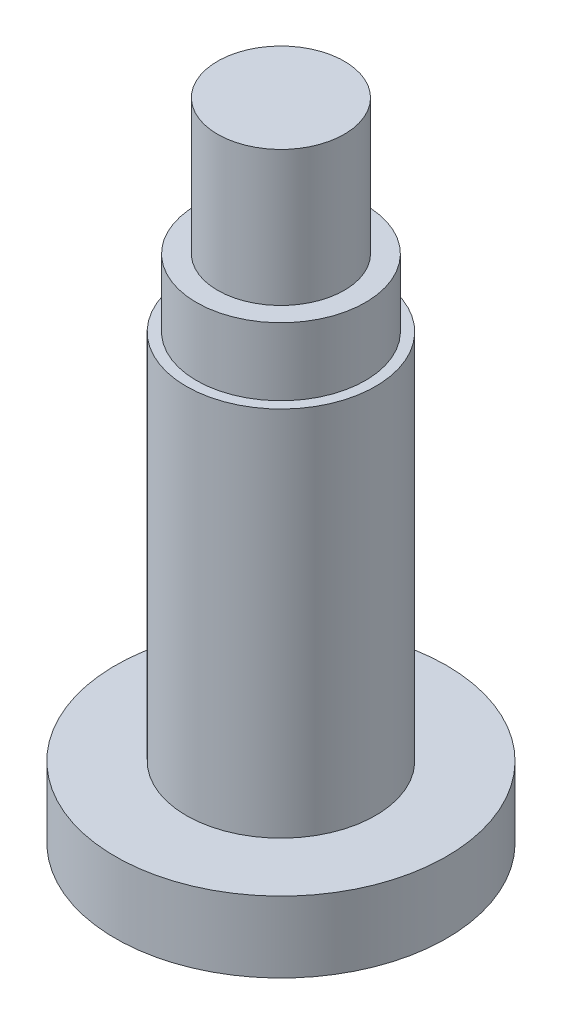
ISO-10303-21;
HEADER;
FILE_DESCRIPTION(('STEP AP214'),'2;1');
FILE_NAME('part.step','',(''),(''),'','','');
FILE_SCHEMA(('AUTOMOTIVE_DESIGN { 1 0 10303 214 1 1 1 1 }'));
ENDSEC;
DATA;
#1=APPLICATION_CONTEXT('core data for automotive mechanical design processes');
#2=APPLICATION_PROTOCOL_DEFINITION('international standard','automotive_design',2000,#1);
#3=PRODUCT_CONTEXT('',#1,'mechanical');
#4=PRODUCT('Part','Part','',(#3));
#5=PRODUCT_RELATED_PRODUCT_CATEGORY('part','',(#4));
#6=PRODUCT_DEFINITION_FORMATION('','',#4);
#7=PRODUCT_DEFINITION_CONTEXT('part definition',#1,'design');
#8=PRODUCT_DEFINITION('design','',#6,#7);
#9=PRODUCT_DEFINITION_SHAPE('','',#8);
#10=(LENGTH_UNIT() NAMED_UNIT(*) SI_UNIT(.MILLI.,.METRE.));
#11=(NAMED_UNIT(*) PLANE_ANGLE_UNIT() SI_UNIT($,.RADIAN.));
#12=(NAMED_UNIT(*) SI_UNIT($,.STERADIAN.) SOLID_ANGLE_UNIT());
#13=UNCERTAINTY_MEASURE_WITH_UNIT(LENGTH_MEASURE(1.E-05),#10,'distance_accuracy_value','');
#14=(GEOMETRIC_REPRESENTATION_CONTEXT(3) GLOBAL_UNCERTAINTY_ASSIGNED_CONTEXT((#13)) GLOBAL_UNIT_ASSIGNED_CONTEXT((#10,
#11,#12)) REPRESENTATION_CONTEXT('',''));
#15=CARTESIAN_POINT('',(0.,0.,0.));
#16=DIRECTION('',(0.,0.,1.));
#17=DIRECTION('',(1.,0.,0.));
#18=AXIS2_PLACEMENT_3D('',#15,#16,#17);
#19=CARTESIAN_POINT('',(0.,6.604,0.));
#20=DIRECTION('',(0.,-1.,0.));
#21=DIRECTION('',(0.,0.,-1.));
#22=AXIS2_PLACEMENT_3D('',#19,#20,#21);
#23=CYLINDRICAL_SURFACE('',#22,12.446);
#24=CARTESIAN_POINT('',(0.,6.604,0.));
#25=DIRECTION('',(0.,1.,0.));
#26=DIRECTION('',(0.,0.,1.));
#27=AXIS2_PLACEMENT_3D('',#24,#25,#26);
#28=CIRCLE('',#27,12.446);
#29=CARTESIAN_POINT('',(0.,6.604,-12.446));
#30=VERTEX_POINT('',#29);
#31=EDGE_CURVE('E11',#30,#30,#28,.T.);
#32=CARTESIAN_POINT('',(0.,1.27,0.));
#33=DIRECTION('',(0.,-1.,0.));
#34=DIRECTION('',(0.,0.,-1.));
#35=AXIS2_PLACEMENT_3D('',#32,#33,#34);
#36=CIRCLE('',#35,12.446);
#37=CARTESIAN_POINT('',(0.,1.27,-12.446));
#38=VERTEX_POINT('',#37);
#39=EDGE_CURVE('E32',#38,#38,#36,.T.);
#40=CARTESIAN_POINT('',(0.,6.604,-12.446));
#41=CARTESIAN_POINT('',(0.,6.5484375,-12.446));
#42=CARTESIAN_POINT('',(0.,6.492875,-12.446));
#43=CARTESIAN_POINT('',(0.,6.38175,-12.446));
#44=CARTESIAN_POINT('',(0.,6.3261875,-12.446));
#45=CARTESIAN_POINT('',(0.,6.2150625,-12.446));
#46=CARTESIAN_POINT('',(0.,6.1595,-12.446));
#47=CARTESIAN_POINT('',(0.,6.048375,-12.446));
#48=CARTESIAN_POINT('',(0.,5.9928125,-12.446));
#49=CARTESIAN_POINT('',(0.,5.8816875,-12.446));
#50=CARTESIAN_POINT('',(0.,5.826125,-12.446));
#51=CARTESIAN_POINT('',(0.,5.715,-12.446));
#52=CARTESIAN_POINT('',(0.,5.6594375,-12.446));
#53=CARTESIAN_POINT('',(0.,5.5483125,-12.446));
#54=CARTESIAN_POINT('',(0.,5.49275,-12.446));
#55=CARTESIAN_POINT('',(0.,5.381625,-12.446));
#56=CARTESIAN_POINT('',(0.,5.3260625,-12.446));
#57=CARTESIAN_POINT('',(0.,5.2149375,-12.446));
#58=CARTESIAN_POINT('',(0.,5.159375,-12.446));
#59=CARTESIAN_POINT('',(0.,5.04825,-12.446));
#60=CARTESIAN_POINT('',(0.,4.9926875,-12.446));
#61=CARTESIAN_POINT('',(0.,4.8815625,-12.446));
#62=CARTESIAN_POINT('',(0.,4.826,-12.446));
#63=CARTESIAN_POINT('',(0.,4.714875,-12.446));
#64=CARTESIAN_POINT('',(0.,4.6593125,-12.446));
#65=CARTESIAN_POINT('',(0.,4.5481875,-12.446));
#66=CARTESIAN_POINT('',(0.,4.492625,-12.446));
#67=CARTESIAN_POINT('',(0.,4.3815,-12.446));
#68=CARTESIAN_POINT('',(0.,4.3259375,-12.446));
#69=CARTESIAN_POINT('',(0.,4.2148125,-12.446));
#70=CARTESIAN_POINT('',(0.,4.15925,-12.446));
#71=CARTESIAN_POINT('',(0.,4.048125,-12.446));
#72=CARTESIAN_POINT('',(0.,3.9925625,-12.446));
#73=CARTESIAN_POINT('',(0.,3.8814375,-12.446));
#74=CARTESIAN_POINT('',(0.,3.825875,-12.446));
#75=CARTESIAN_POINT('',(0.,3.71475,-12.446));
#76=CARTESIAN_POINT('',(0.,3.6591875,-12.446));
#77=CARTESIAN_POINT('',(0.,3.5480625,-12.446));
#78=CARTESIAN_POINT('',(0.,3.4925,-12.446));
#79=CARTESIAN_POINT('',(0.,3.381375,-12.446));
#80=CARTESIAN_POINT('',(0.,3.3258125,-12.446));
#81=CARTESIAN_POINT('',(0.,3.2146875,-12.446));
#82=CARTESIAN_POINT('',(0.,3.159125,-12.446));
#83=CARTESIAN_POINT('',(0.,3.048,-12.446));
#84=CARTESIAN_POINT('',(0.,2.9924375,-12.446));
#85=CARTESIAN_POINT('',(0.,2.8813125,-12.446));
#86=CARTESIAN_POINT('',(0.,2.82575,-12.446));
#87=CARTESIAN_POINT('',(0.,2.714625,-12.446));
#88=CARTESIAN_POINT('',(0.,2.6590625,-12.446));
#89=CARTESIAN_POINT('',(0.,2.5479375,-12.446));
#90=CARTESIAN_POINT('',(0.,2.492375,-12.446));
#91=CARTESIAN_POINT('',(0.,2.38125,-12.446));
#92=CARTESIAN_POINT('',(0.,2.3256875,-12.446));
#93=CARTESIAN_POINT('',(0.,2.2145625,-12.446));
#94=CARTESIAN_POINT('',(0.,2.159,-12.446));
#95=CARTESIAN_POINT('',(0.,2.047875,-12.446));
#96=CARTESIAN_POINT('',(0.,1.9923125,-12.446));
#97=CARTESIAN_POINT('',(0.,1.8811875,-12.446));
#98=CARTESIAN_POINT('',(0.,1.825625,-12.446));
#99=CARTESIAN_POINT('',(0.,1.7145,-12.446));
#100=CARTESIAN_POINT('',(0.,1.6589375,-12.446));
#101=CARTESIAN_POINT('',(0.,1.5478125,-12.446));
#102=CARTESIAN_POINT('',(0.,1.49225,-12.446));
#103=CARTESIAN_POINT('',(0.,1.381125,-12.446));
#104=CARTESIAN_POINT('',(0.,1.3255625,-12.446));
#105=CARTESIAN_POINT('',(0.,1.27,-12.446));
#106=B_SPLINE_CURVE_WITH_KNOTS('',3,(#40,#41,#42,#43,#44,#45,#46,#47,#48,#49,#50,#51,#52,#53,
#54,#55,#56,#57,#58,#59,#60,#61,#62,#63,#64,#65,#66,#67,#68,#69,#70,#71,#72,#73,#74,#75,#76,#77,
#78,#79,#80,#81,#82,#83,#84,#85,#86,#87,#88,#89,#90,#91,#92,#93,#94,#95,#96,#97,#98,#99,#100,
#101,#102,#103,#104,#105),.UNSPECIFIED.,.F.,.F.,(4,2,2,2,2,2,2,2,2,2,2,2,2,2,2,2,2,2,2,2,2,2,2,
2,2,2,2,2,2,2,2,2,4),(0.,0.1666875,0.333375,0.500062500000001,0.666750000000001,0.8334375,
1.000125,1.1668125,1.3335,1.5001875,1.666875,1.8335625,2.00025,2.1669375,2.333625,2.5003125,
2.667,2.8336875,3.000375,3.1670625,3.33375,3.5004375,3.667125,3.8338125,4.0005,4.1671875,
4.333875,4.5005625,4.66725,4.8339375,5.000625,5.1673125,5.334),.UNSPECIFIED.);
#107=EDGE_CURVE('BSEAM29',#30,#38,#106,.T.);
#108=ORIENTED_EDGE('',*,*,#31,.F.);
#109=ORIENTED_EDGE('',*,*,#39,.F.);
#110=ORIENTED_EDGE('',*,*,#107,.T.);
#111=ORIENTED_EDGE('',*,*,#107,.F.);
#112=EDGE_LOOP('',(#108,#110,#109,#111));
#113=FACE_BOUND('',#112,.T.);
#114=ADVANCED_FACE('F29',(#113),#23,.T.);
#115=CARTESIAN_POINT('',(0.,39.624,0.));
#116=DIRECTION('',(0.,1.,0.));
#117=DIRECTION('',(0.,0.,1.));
#118=AXIS2_PLACEMENT_3D('',#115,#116,#117);
#119=PLANE('',#118);
#120=CARTESIAN_POINT('',(0.,39.624,0.));
#121=DIRECTION('',(0.,1.,0.));
#122=DIRECTION('',(0.,0.,1.));
#123=AXIS2_PLACEMENT_3D('',#120,#121,#122);
#124=CIRCLE('',#123,6.35);
#125=CARTESIAN_POINT('',(0.,39.624,6.35));
#126=VERTEX_POINT('',#125);
#127=EDGE_CURVE('E45',#126,#126,#124,.T.);
#128=ORIENTED_EDGE('',*,*,#127,.T.);
#129=EDGE_LOOP('',(#128));
#130=FACE_BOUND('',#129,.T.);
#131=CARTESIAN_POINT('',(0.,39.624,0.));
#132=DIRECTION('',(0.,1.,0.));
#133=DIRECTION('',(0.,0.,1.));
#134=AXIS2_PLACEMENT_3D('',#131,#132,#133);
#135=CIRCLE('',#134,4.7625);
#136=CARTESIAN_POINT('',(0.,39.624,4.7625));
#137=VERTEX_POINT('',#136);
#138=EDGE_CURVE('E54',#137,#137,#135,.T.);
#139=ORIENTED_EDGE('',*,*,#138,.F.);
#140=EDGE_LOOP('',(#139));
#141=FACE_BOUND('',#140,.T.);
#142=ADVANCED_FACE('F95',(#130,#141),#119,.T.);
#143=CARTESIAN_POINT('',(0.,34.544,0.));
#144=DIRECTION('',(0.,1.,0.));
#145=DIRECTION('',(0.,0.,1.));
#146=AXIS2_PLACEMENT_3D('',#143,#144,#145);
#147=PLANE('',#146);
#148=CARTESIAN_POINT('',(0.,34.544,0.));
#149=DIRECTION('',(0.,1.,0.));
#150=DIRECTION('',(0.,0.,1.));
#151=AXIS2_PLACEMENT_3D('',#148,#149,#150);
#152=CIRCLE('',#151,7.112);
#153=CARTESIAN_POINT('',(0.,34.544,7.112));
#154=VERTEX_POINT('',#153);
#155=EDGE_CURVE('E36',#154,#154,#152,.T.);
#156=ORIENTED_EDGE('',*,*,#155,.T.);
#157=EDGE_LOOP('',(#156));
#158=FACE_BOUND('',#157,.T.);
#159=CARTESIAN_POINT('',(0.,34.544,0.));
#160=DIRECTION('',(0.,1.,0.));
#161=DIRECTION('',(0.,0.,1.));
#162=AXIS2_PLACEMENT_3D('',#159,#160,#161);
#163=CIRCLE('',#162,6.35);
#164=CARTESIAN_POINT('',(0.,34.544,6.35));
#165=VERTEX_POINT('',#164);
#166=EDGE_CURVE('E48',#165,#165,#163,.T.);
#167=ORIENTED_EDGE('',*,*,#166,.F.);
#168=EDGE_LOOP('',(#167));
#169=FACE_BOUND('',#168,.T.);
#170=ADVANCED_FACE('F100',(#158,#169),#147,.T.);
#171=CARTESIAN_POINT('',(0.,6.604,0.));
#172=DIRECTION('',(0.,1.,0.));
#173=DIRECTION('',(0.,0.,1.));
#174=AXIS2_PLACEMENT_3D('',#171,#172,#173);
#175=PLANE('',#174);
#176=ORIENTED_EDGE('',*,*,#31,.T.);
#177=EDGE_LOOP('',(#176));
#178=FACE_BOUND('',#177,.T.);
#179=CARTESIAN_POINT('',(0.,6.604,0.));
#180=DIRECTION('',(0.,1.,0.));
#181=DIRECTION('',(0.,0.,1.));
#182=AXIS2_PLACEMENT_3D('',#179,#180,#181);
#183=CIRCLE('',#182,7.112);
#184=CARTESIAN_POINT('',(0.,6.604,7.112));
#185=VERTEX_POINT('',#184);
#186=EDGE_CURVE('E40',#185,#185,#183,.T.);
#187=ORIENTED_EDGE('',*,*,#186,.F.);
#188=EDGE_LOOP('',(#187));
#189=FACE_BOUND('',#188,.T.);
#190=ADVANCED_FACE('F110',(#178,#189),#175,.T.);
#191=CARTESIAN_POINT('',(0.,34.544,0.));
#192=DIRECTION('',(0.,-1.,0.));
#193=DIRECTION('',(0.,0.,-1.));
#194=AXIS2_PLACEMENT_3D('',#191,#192,#193);
#195=CYLINDRICAL_SURFACE('',#194,7.112);
#196=ORIENTED_EDGE('',*,*,#155,.F.);
#197=EDGE_LOOP('',(#196));
#198=FACE_BOUND('',#197,.T.);
#199=ORIENTED_EDGE('',*,*,#186,.T.);
#200=EDGE_LOOP('',(#199));
#201=FACE_BOUND('',#200,.T.);
#202=ADVANCED_FACE('F120',(#198,#201),#195,.T.);
#203=CARTESIAN_POINT('',(0.,39.624,0.));
#204=DIRECTION('',(0.,-1.,0.));
#205=DIRECTION('',(0.,0.,-1.));
#206=AXIS2_PLACEMENT_3D('',#203,#204,#205);
#207=CYLINDRICAL_SURFACE('',#206,6.35);
#208=ORIENTED_EDGE('',*,*,#127,.F.);
#209=EDGE_LOOP('',(#208));
#210=FACE_BOUND('',#209,.T.);
#211=ORIENTED_EDGE('',*,*,#166,.T.);
#212=EDGE_LOOP('',(#211));
#213=FACE_BOUND('',#212,.T.);
#214=ADVANCED_FACE('F118',(#210,#213),#207,.T.);
#215=CARTESIAN_POINT('',(0.,49.784,0.));
#216=DIRECTION('',(0.,-1.,0.));
#217=DIRECTION('',(0.,0.,-1.));
#218=AXIS2_PLACEMENT_3D('',#215,#216,#217);
#219=CYLINDRICAL_SURFACE('',#218,4.7625);
#220=CARTESIAN_POINT('',(0.,49.784,0.));
#221=DIRECTION('',(0.,1.,0.));
#222=DIRECTION('',(0.,0.,1.));
#223=AXIS2_PLACEMENT_3D('',#220,#221,#222);
#224=CIRCLE('',#223,4.7625);
#225=CARTESIAN_POINT('',(0.,49.784,4.7625));
#226=VERTEX_POINT('',#225);
#227=EDGE_CURVE('E51',#226,#226,#224,.T.);
#228=ORIENTED_EDGE('',*,*,#227,.F.);
#229=EDGE_LOOP('',(#228));
#230=FACE_BOUND('',#229,.T.);
#231=ORIENTED_EDGE('',*,*,#138,.T.);
#232=EDGE_LOOP('',(#231));
#233=FACE_BOUND('',#232,.T.);
#234=ADVANCED_FACE('F116',(#230,#233),#219,.T.);
#235=CARTESIAN_POINT('',(0.,49.784,0.));
#236=DIRECTION('',(0.,1.,0.));
#237=DIRECTION('',(0.,0.,1.));
#238=AXIS2_PLACEMENT_3D('',#235,#236,#237);
#239=PLANE('',#238);
#240=ORIENTED_EDGE('',*,*,#227,.T.);
#241=EDGE_LOOP('',(#240));
#242=FACE_BOUND('',#241,.T.);
#243=ADVANCED_FACE('F91',(#242),#239,.T.);
#244=CARTESIAN_POINT('',(0.,1.27,0.));
#245=DIRECTION('',(0.,-1.,0.));
#246=DIRECTION('',(0.,0.,-1.));
#247=AXIS2_PLACEMENT_3D('',#244,#245,#246);
#248=PLANE('',#247);
#249=CARTESIAN_POINT('',(0.,1.27,0.));
#250=DIRECTION('',(0.,-1.,0.));
#251=DIRECTION('',(0.,0.,-1.));
#252=AXIS2_PLACEMENT_3D('',#249,#250,#251);
#253=CIRCLE('',#252,9.017);
#254=CARTESIAN_POINT('',(0.,1.27,-9.017));
#255=VERTEX_POINT('',#254);
#256=EDGE_CURVE('E69',#255,#255,#253,.T.);
#257=ORIENTED_EDGE('',*,*,#256,.F.);
#258=EDGE_LOOP('',(#257));
#259=FACE_BOUND('',#258,.T.);
#260=ORIENTED_EDGE('',*,*,#39,.T.);
#261=EDGE_LOOP('',(#260));
#262=FACE_BOUND('',#261,.T.);
#263=ADVANCED_FACE('F81',(#259,#262),#248,.T.);
#264=CARTESIAN_POINT('',(0.,1.27,0.));
#265=DIRECTION('',(0.,-1.,0.));
#266=DIRECTION('',(0.,0.,-1.));
#267=AXIS2_PLACEMENT_3D('',#264,#265,#266);
#268=CYLINDRICAL_SURFACE('',#267,9.017);
#269=ORIENTED_EDGE('',*,*,#256,.T.);
#270=EDGE_LOOP('',(#269));
#271=FACE_BOUND('',#270,.T.);
#272=CARTESIAN_POINT('',(0.,0.,0.));
#273=DIRECTION('',(0.,-1.,0.));
#274=DIRECTION('',(0.,0.,-1.));
#275=AXIS2_PLACEMENT_3D('',#272,#273,#274);
#276=CIRCLE('',#275,9.017);
#277=CARTESIAN_POINT('',(0.,0.,-9.017));
#278=VERTEX_POINT('',#277);
#279=EDGE_CURVE('E72',#278,#278,#276,.T.);
#280=ORIENTED_EDGE('',*,*,#279,.F.);
#281=EDGE_LOOP('',(#280));
#282=FACE_BOUND('',#281,.T.);
#283=ADVANCED_FACE('F78',(#271,#282),#268,.T.);
#284=CARTESIAN_POINT('',(0.,24.13,0.));
#285=DIRECTION('',(0.,-1.,0.));
#286=DIRECTION('',(0.,0.,-1.));
#287=AXIS2_PLACEMENT_3D('',#284,#285,#286);
#288=PLANE('',#287);
#289=CARTESIAN_POINT('',(0.,24.13,0.));
#290=DIRECTION('',(0.,-1.,0.));
#291=DIRECTION('',(0.,0.,-1.));
#292=AXIS2_PLACEMENT_3D('',#289,#290,#291);
#293=CIRCLE('',#292,1.27);
#294=CARTESIAN_POINT('',(0.,24.13,1.27));
#295=VERTEX_POINT('',#294);
#296=EDGE_CURVE('E63',#295,#295,#293,.T.);
#297=ORIENTED_EDGE('',*,*,#296,.T.);
#298=EDGE_LOOP('',(#297));
#299=FACE_BOUND('',#298,.T.);
#300=ADVANCED_FACE('F80',(#299),#288,.T.);
#301=CARTESIAN_POINT('',(0.,24.13,0.));
#302=DIRECTION('',(0.,1.,0.));
#303=DIRECTION('',(0.,0.,1.));
#304=AXIS2_PLACEMENT_3D('',#301,#302,#303);
#305=CYLINDRICAL_SURFACE('',#304,1.27);
#306=CARTESIAN_POINT('',(0.,24.892,0.));
#307=DIRECTION('',(0.,-1.,0.));
#308=DIRECTION('',(0.,0.,-1.));
#309=AXIS2_PLACEMENT_3D('',#306,#307,#308);
#310=CIRCLE('',#309,1.27);
#311=CARTESIAN_POINT('',(0.,24.892,1.27));
#312=VERTEX_POINT('',#311);
#313=EDGE_CURVE('E66',#312,#312,#310,.T.);
#314=CARTESIAN_POINT('',(0.,24.13,1.27));
#315=CARTESIAN_POINT('',(0.,24.1379375,1.27));
#316=CARTESIAN_POINT('',(0.,24.145875,1.27));
#317=CARTESIAN_POINT('',(0.,24.16175,1.27));
#318=CARTESIAN_POINT('',(0.,24.1696875,1.27));
#319=CARTESIAN_POINT('',(0.,24.1855625,1.27));
#320=CARTESIAN_POINT('',(0.,24.1935,1.27));
#321=CARTESIAN_POINT('',(0.,24.209375,1.27));
#322=CARTESIAN_POINT('',(0.,24.2173125,1.27));
#323=CARTESIAN_POINT('',(0.,24.2331875,1.27));
#324=CARTESIAN_POINT('',(0.,24.241125,1.27));
#325=CARTESIAN_POINT('',(0.,24.257,1.27));
#326=CARTESIAN_POINT('',(0.,24.2649375,1.27));
#327=CARTESIAN_POINT('',(0.,24.2808125,1.27));
#328=CARTESIAN_POINT('',(0.,24.28875,1.27));
#329=CARTESIAN_POINT('',(0.,24.304625,1.27));
#330=CARTESIAN_POINT('',(0.,24.3125625,1.27));
#331=CARTESIAN_POINT('',(0.,24.3284375,1.27));
#332=CARTESIAN_POINT('',(0.,24.336375,1.27));
#333=CARTESIAN_POINT('',(0.,24.35225,1.27));
#334=CARTESIAN_POINT('',(0.,24.3601875,1.27));
#335=CARTESIAN_POINT('',(0.,24.3760625,1.27));
#336=CARTESIAN_POINT('',(0.,24.384,1.27));
#337=CARTESIAN_POINT('',(0.,24.399875,1.27));
#338=CARTESIAN_POINT('',(0.,24.4078125,1.27));
#339=CARTESIAN_POINT('',(0.,24.4236875,1.27));
#340=CARTESIAN_POINT('',(0.,24.431625,1.27));
#341=CARTESIAN_POINT('',(0.,24.4475,1.27));
#342=CARTESIAN_POINT('',(0.,24.4554375,1.27));
#343=CARTESIAN_POINT('',(0.,24.4713125,1.27));
#344=CARTESIAN_POINT('',(0.,24.47925,1.27));
#345=CARTESIAN_POINT('',(0.,24.495125,1.27));
#346=CARTESIAN_POINT('',(0.,24.5030625,1.27));
#347=CARTESIAN_POINT('',(0.,24.5189375,1.27));
#348=CARTESIAN_POINT('',(0.,24.526875,1.27));
#349=CARTESIAN_POINT('',(0.,24.54275,1.27));
#350=CARTESIAN_POINT('',(0.,24.5506875,1.27));
#351=CARTESIAN_POINT('',(0.,24.5665625,1.27));
#352=CARTESIAN_POINT('',(0.,24.5745,1.27));
#353=CARTESIAN_POINT('',(0.,24.590375,1.27));
#354=CARTESIAN_POINT('',(0.,24.5983125,1.27));
#355=CARTESIAN_POINT('',(0.,24.6141875,1.27));
#356=CARTESIAN_POINT('',(0.,24.622125,1.27));
#357=CARTESIAN_POINT('',(0.,24.638,1.27));
#358=CARTESIAN_POINT('',(0.,24.6459375,1.27));
#359=CARTESIAN_POINT('',(0.,24.6618125,1.27));
#360=CARTESIAN_POINT('',(0.,24.66975,1.27));
#361=CARTESIAN_POINT('',(0.,24.685625,1.27));
#362=CARTESIAN_POINT('',(0.,24.6935625,1.27));
#363=CARTESIAN_POINT('',(0.,24.7094375,1.27));
#364=CARTESIAN_POINT('',(0.,24.717375,1.27));
#365=CARTESIAN_POINT('',(0.,24.73325,1.27));
#366=CARTESIAN_POINT('',(0.,24.7411875,1.27));
#367=CARTESIAN_POINT('',(0.,24.7570625,1.27));
#368=CARTESIAN_POINT('',(0.,24.765,1.27));
#369=CARTESIAN_POINT('',(0.,24.780875,1.27));
#370=CARTESIAN_POINT('',(0.,24.7888125,1.27));
#371=CARTESIAN_POINT('',(0.,24.8046875,1.27));
#372=CARTESIAN_POINT('',(0.,24.812625,1.27));
#373=CARTESIAN_POINT('',(0.,24.8285,1.27));
#374=CARTESIAN_POINT('',(0.,24.8364375,1.27));
#375=CARTESIAN_POINT('',(0.,24.8523125,1.27));
#376=CARTESIAN_POINT('',(0.,24.86025,1.27));
#377=CARTESIAN_POINT('',(0.,24.876125,1.27));
#378=CARTESIAN_POINT('',(0.,24.8840625,1.27));
#379=CARTESIAN_POINT('',(0.,24.892,1.27));
#380=B_SPLINE_CURVE_WITH_KNOTS('',3,(#314,#315,#316,#317,#318,#319,#320,#321,#322,#323,#324,
#325,#326,#327,#328,#329,#330,#331,#332,#333,#334,#335,#336,#337,#338,#339,#340,#341,#342,#343,
#344,#345,#346,#347,#348,#349,#350,#351,#352,#353,#354,#355,#356,#357,#358,#359,#360,#361,#362,
#363,#364,#365,#366,#367,#368,#369,#370,#371,#372,#373,#374,#375,#376,#377,#378,#379),
.UNSPECIFIED.,.F.,.F.,(4,2,2,2,2,2,2,2,2,2,2,2,2,2,2,2,2,2,2,2,2,2,2,2,2,2,2,2,2,2,2,2,4),(0.,
0.0238124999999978,0.0476249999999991,0.0714374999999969,0.0952499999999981,0.119062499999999,
0.142874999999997,0.166687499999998,0.1905,0.214312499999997,0.238124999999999,
0.261937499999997,0.285749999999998,0.309562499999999,0.333374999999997,0.357187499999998,
0.380999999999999,0.404812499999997,0.428624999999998,0.452437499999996,0.476249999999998,
0.500062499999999,0.523874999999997,0.547687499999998,0.571499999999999,0.595312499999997,
0.619124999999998,0.642937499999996,0.666749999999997,0.690562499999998,0.714374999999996,
0.738187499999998,0.761999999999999),.UNSPECIFIED.);
#381=EDGE_CURVE('BSEAM88',#295,#312,#380,.T.);
#382=ORIENTED_EDGE('',*,*,#296,.F.);
#383=ORIENTED_EDGE('',*,*,#313,.T.);
#384=ORIENTED_EDGE('',*,*,#381,.T.);
#385=ORIENTED_EDGE('',*,*,#381,.F.);
#386=EDGE_LOOP('',(#382,#384,#383,#385));
#387=FACE_BOUND('',#386,.T.);
#388=ADVANCED_FACE('F88',(#387),#305,.T.);
#389=CARTESIAN_POINT('',(0.,24.892,0.));
#390=DIRECTION('',(0.,-1.,0.));
#391=DIRECTION('',(0.,0.,-1.));
#392=AXIS2_PLACEMENT_3D('',#389,#390,#391);
#393=PLANE('',#392);
#394=CARTESIAN_POINT('',(0.,24.892,0.));
#395=DIRECTION('',(0.,-1.,0.));
#396=DIRECTION('',(0.,0.,-1.));
#397=AXIS2_PLACEMENT_3D('',#394,#395,#396);
#398=CIRCLE('',#397,6.5024);
#399=CARTESIAN_POINT('',(0.,24.892,-6.5024));
#400=VERTEX_POINT('',#399);
#401=EDGE_CURVE('E57',#400,#400,#398,.T.);
#402=ORIENTED_EDGE('',*,*,#401,.T.);
#403=EDGE_LOOP('',(#402));
#404=FACE_BOUND('',#403,.T.);
#405=ORIENTED_EDGE('',*,*,#313,.F.);
#406=EDGE_LOOP('',(#405));
#407=FACE_BOUND('',#406,.T.);
#408=ADVANCED_FACE('F183',(#404,#407),#393,.T.);
#409=CARTESIAN_POINT('',(0.,24.892,0.));
#410=DIRECTION('',(0.,-1.,0.));
#411=DIRECTION('',(0.,0.,-1.));
#412=AXIS2_PLACEMENT_3D('',#409,#410,#411);
#413=CYLINDRICAL_SURFACE('',#412,6.5024);
#414=ORIENTED_EDGE('',*,*,#401,.F.);
#415=EDGE_LOOP('',(#414));
#416=FACE_BOUND('',#415,.T.);
#417=CARTESIAN_POINT('',(0.,0.,0.));
#418=DIRECTION('',(0.,-1.,0.));
#419=DIRECTION('',(0.,0.,-1.));
#420=AXIS2_PLACEMENT_3D('',#417,#418,#419);
#421=CIRCLE('',#420,6.5024);
#422=CARTESIAN_POINT('',(0.,0.,-6.5024));
#423=VERTEX_POINT('',#422);
#424=EDGE_CURVE('E60',#423,#423,#421,.T.);
#425=ORIENTED_EDGE('',*,*,#424,.T.);
#426=EDGE_LOOP('',(#425));
#427=FACE_BOUND('',#426,.T.);
#428=ADVANCED_FACE('F127',(#416,#427),#413,.F.);
#429=CARTESIAN_POINT('',(0.,0.,0.));
#430=DIRECTION('',(0.,1.,0.));
#431=DIRECTION('',(0.,0.,1.));
#432=AXIS2_PLACEMENT_3D('',#429,#430,#431);
#433=PLANE('',#432);
#434=ORIENTED_EDGE('',*,*,#424,.F.);
#435=EDGE_LOOP('',(#434));
#436=FACE_BOUND('',#435,.T.);
#437=ORIENTED_EDGE('',*,*,#279,.T.);
#438=EDGE_LOOP('',(#437));
#439=FACE_BOUND('',#438,.T.);
#440=ADVANCED_FACE('F76',(#436,#439),#433,.F.);
#441=CLOSED_SHELL('',(#114,#142,#170,#190,#202,#214,#234,#243,#263,#283,#300,#388,#408,#428,#440));
#442=MANIFOLD_SOLID_BREP('B2',#441);
#443=ADVANCED_BREP_SHAPE_REPRESENTATION('',(#18,#442),#14);
#444=SHAPE_DEFINITION_REPRESENTATION(#9,#443);
ENDSEC;
END-ISO-10303-21;
